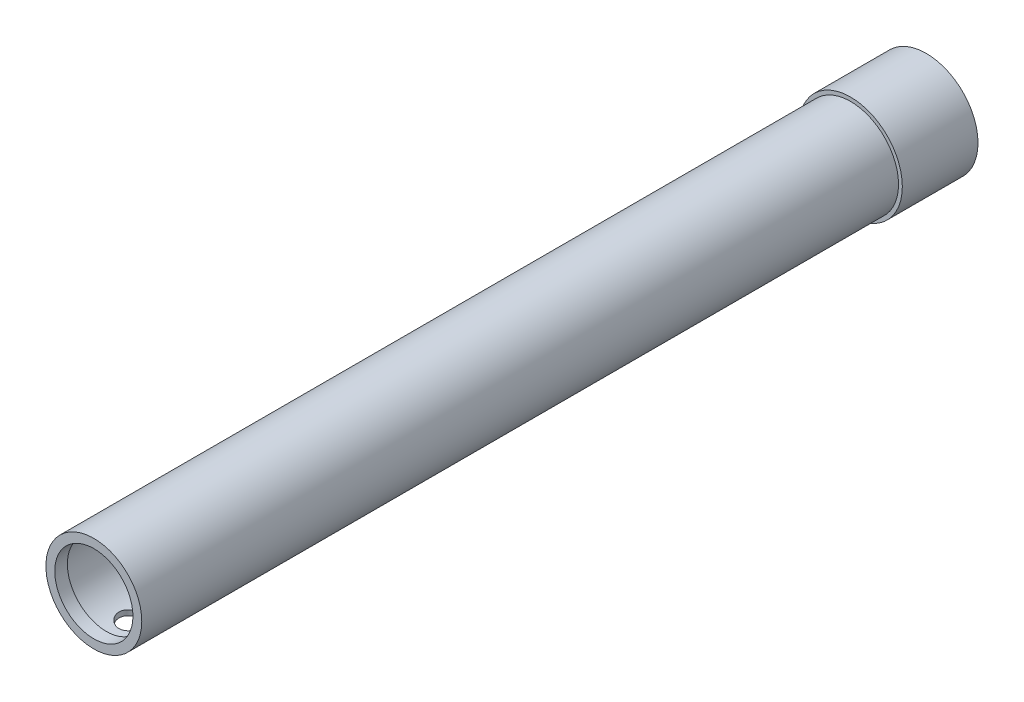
from build123d import *

# Parameters (mm, degrees)
SKETCH2_R           = 19
BOSS_EXTRUDE1_DEPTH = 300
SKETCH3_R           = 20.5
BOSS_EXTRUDE2_DEPTH = 30
SKETCH4_R           = 17
CUT_EXTRUDE1_DEPTH  = 300
BOSS_EXTRUDE3_START = -5
SKETCH5_R           = 19
SKETCH5_R_2         = 15.5
BOSS_EXTRUDE3_DEPTH = 5
SKETCH6_R           = 5
CUT_EXTRUDE2_DEPTH  = 302.39757796
SKETCH7_R           = 17.25
CUT_EXTRUDE3_DEPTH  = 30


with BuildPart() as part:
    # Sketch2 → Boss-Extrude1 (new body)
    with BuildSketch(Plane.XY):
        Circle(SKETCH2_R)
    extrude(amount=BOSS_EXTRUDE1_DEPTH)

    # Sketch3 → Boss-Extrude2 (add)
    with BuildSketch(Plane.XY):
        Circle(SKETCH3_R)
    extrude(amount=-BOSS_EXTRUDE2_DEPTH)

    # Sketch4 → Cut-Extrude1 (cut)
    with BuildSketch(Plane.XY.offset(300)):
        Circle(SKETCH4_R)
    extrude(amount=-CUT_EXTRUDE1_DEPTH, mode=Mode.SUBTRACT)

    # Sketch5 → Boss-Extrude3 (add)
    with BuildSketch(Plane.XY.offset(300).offset(BOSS_EXTRUDE3_START)):
        Circle(SKETCH5_R)
        Circle(SKETCH5_R_2, mode=Mode.SUBTRACT)
    extrude(amount=BOSS_EXTRUDE3_DEPTH)

    # Sketch6 → Cut-Extrude2 (cut, through all)
    with BuildSketch(Plane(origin=(0, 0, 0), x_dir=(1, 0, 0), z_dir=(0, 1, 0))):
        with Locations(Location((0, -285, 0), (0, 0, 270))):
            Circle(SKETCH6_R)
    extrude(amount=-CUT_EXTRUDE2_DEPTH, mode=Mode.SUBTRACT)

    # Sketch7 → Cut-Extrude3 (cut)
    with BuildSketch(Plane(origin=(0, 0, -30), x_dir=(-1, 0, 0), z_dir=(0, 0, -1))):
        Circle(SKETCH7_R)
    extrude(amount=-CUT_EXTRUDE3_DEPTH, mode=Mode.SUBTRACT)


solid = part.part
